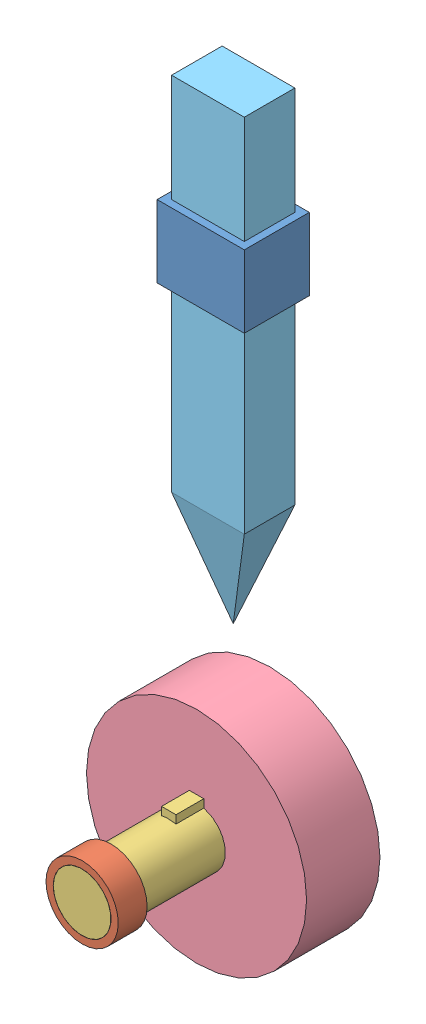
SolidWorks assembly Cam Synthesis.SLDASM, configuration Undefined_Cam_Profile (file format 11000). Lengths in mm.
Overall size (152.4 515.91 130).
5 component instances, 5 part files, 7 mates.
Components (placement in the parent):
- Follower_Guide-1: Follower_Guide.SLDPRT [Default] at (0.0002 975.1607 -94.6) x (0 0 1) z (0 -1 0) size (45 60.35 50)
- Base-1: Base.SLDPRT [Default] at (0 635 -10) size (50 50 20)
- shaft-1: shaft.SLDPRT [Default] at (0 635 -110) x (-1 0 0) z (0 0 -1) size (40 45 130)
- cam-1: cam.SLDPRT [Undefined_Cam_Profile] at (0 635 -94.6) x (0 1 0) z (0 0 1) size (152.4 152.4 50.8)
- Follower-1: Follower.SLDPRT [Default] at (0.0005 749.7087 -94.6) x (0 1 0) z (0 0 -1) size (325 50.35 35)
Mates (geometry in assembly coordinates):
- Coincident1: coincident: plane of assembly; plane of assembly; plane of Follower_Guide-1 through (-25.1728 950.1607 -112.1) normal (0 0 1); plane of Follower-1 through (-109.0836 1074.7087 -112.1) normal (0 0 -1)
- Coincident2: coincident: plane of assembly; plane of assembly; plane of Follower_Guide-1 through (-25.1728 950.1607 -112.1) normal (1 0 0); plane of Follower-1 through (-25.1728 824.7087 -112.1) normal (-1 0 0)
- Coincident3: coincident: plane of assembly; plane of assembly; plane of shaft-1 through (0 635 10) normal (0 0 1); plane of Base-1 through (0 635 10) normal (0 0 1)
- Concentric1: concentric: cylinder of assembly; cylinder of assembly; cylinder of shaft-1 through (0 635 10) axis (0 0 -1) radius 20; cylinder of Base-1 through (0 635 10) axis (0 0 -1) radius 20
- Coincident6: coincident: plane of assembly; plane of assembly; plane of shaft-1 through (5 660 10) normal (1 0 0); plane of cam-1 through (5 654.3649 -69.2) normal (-1 0 0)
- Coincident7: coincident: plane of assembly; plane of assembly; plane of shaft-1 through (-5 660 10) normal (0 1 0); plane of cam-1 through (-5 660 -69.2) normal (0 -1 0)
- Coincident8: coincident: plane of assembly; plane of assembly; plane of shaft-1 through (0 635 -120) normal (0 0 -1); plane of cam-1 through (121.5787 582.8022 -120) normal (0 0 -1)
